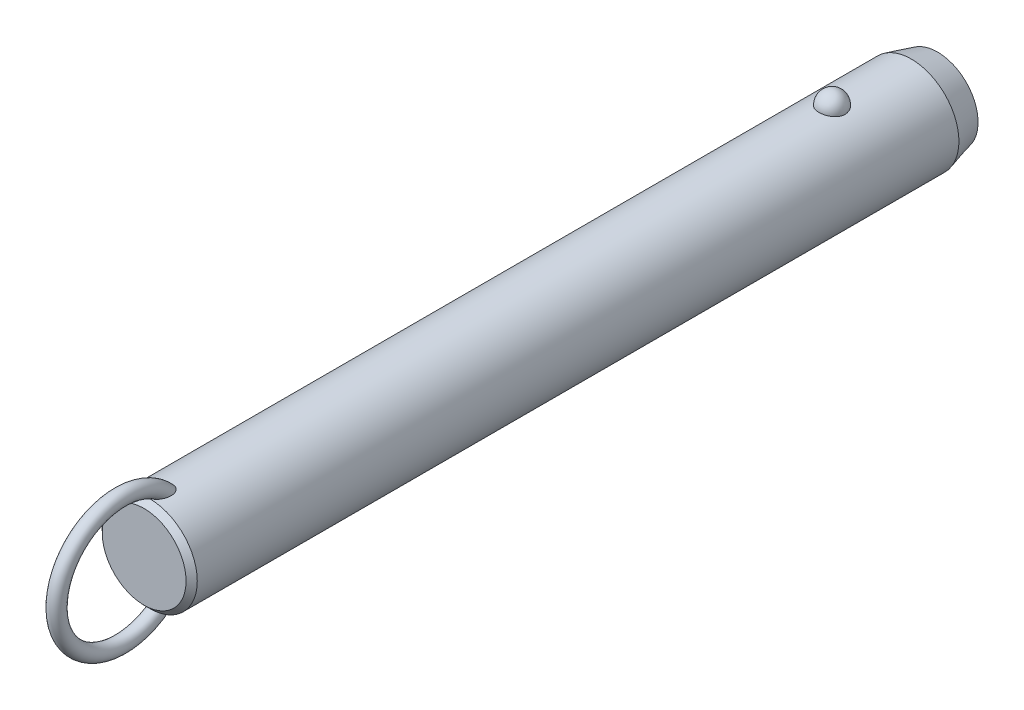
ISO-10303-21;
HEADER;
FILE_DESCRIPTION(('STEP AP214'),'2;1');
FILE_NAME('part.step','',(''),(''),'','','');
FILE_SCHEMA(('AUTOMOTIVE_DESIGN { 1 0 10303 214 1 1 1 1 }'));
ENDSEC;
DATA;
#1=APPLICATION_CONTEXT('core data for automotive mechanical design processes');
#2=APPLICATION_PROTOCOL_DEFINITION('international standard','automotive_design',2000,#1);
#3=PRODUCT_CONTEXT('',#1,'mechanical');
#4=PRODUCT('Part','Part','',(#3));
#5=PRODUCT_RELATED_PRODUCT_CATEGORY('part','',(#4));
#6=PRODUCT_DEFINITION_FORMATION('','',#4);
#7=PRODUCT_DEFINITION_CONTEXT('part definition',#1,'design');
#8=PRODUCT_DEFINITION('design','',#6,#7);
#9=PRODUCT_DEFINITION_SHAPE('','',#8);
#10=(LENGTH_UNIT() NAMED_UNIT(*) SI_UNIT(.MILLI.,.METRE.));
#11=(NAMED_UNIT(*) PLANE_ANGLE_UNIT() SI_UNIT($,.RADIAN.));
#12=(NAMED_UNIT(*) SI_UNIT($,.STERADIAN.) SOLID_ANGLE_UNIT());
#13=UNCERTAINTY_MEASURE_WITH_UNIT(LENGTH_MEASURE(1.E-05),#10,'distance_accuracy_value','');
#14=(GEOMETRIC_REPRESENTATION_CONTEXT(3) GLOBAL_UNCERTAINTY_ASSIGNED_CONTEXT((#13)) GLOBAL_UNIT_ASSIGNED_CONTEXT((#10,
#11,#12)) REPRESENTATION_CONTEXT('',''));
#15=CARTESIAN_POINT('',(0.,0.,0.));
#16=DIRECTION('',(0.,0.,1.));
#17=DIRECTION('',(1.,0.,0.));
#18=AXIS2_PLACEMENT_3D('',#15,#16,#17);
#19=CARTESIAN_POINT('',(0.,0.,167.6));
#20=DIRECTION('',(0.,0.,-1.));
#21=DIRECTION('',(-1.,0.,0.));
#22=AXIS2_PLACEMENT_3D('',#19,#20,#21);
#23=CYLINDRICAL_SURFACE('',#22,12.7);
#24=CARTESIAN_POINT('',(3.46661256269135,12.2177165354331,-3.5));
#25=CARTESIAN_POINT('',(3.4666090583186,12.2177194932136,-3.30432790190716));
#26=CARTESIAN_POINT('',(3.45063567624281,12.2222841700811,-3.10861112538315));
#27=CARTESIAN_POINT('',(3.38712451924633,12.2400345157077,-2.72271899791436));
#28=CARTESIAN_POINT('',(3.33957415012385,12.2532236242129,-2.53254588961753));
#29=CARTESIAN_POINT('',(3.2141234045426,12.286724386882,-2.16324948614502));
#30=CARTESIAN_POINT('',(3.13623639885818,12.3070329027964,-1.98412136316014));
#31=CARTESIAN_POINT('',(2.95205930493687,12.3525018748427,-1.64180592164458));
#32=CARTESIAN_POINT('',(2.84577003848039,12.3776621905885,-1.47861814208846));
#33=CARTESIAN_POINT('',(2.60688050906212,12.4301712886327,-1.17190583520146));
#34=CARTESIAN_POINT('',(2.47415697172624,12.4575299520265,-1.02847897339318));
#35=CARTESIAN_POINT('',(2.18615174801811,12.5112810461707,-0.766177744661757));
#36=CARTESIAN_POINT('',(2.03087002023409,12.5376734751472,-0.647303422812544));
#37=CARTESIAN_POINT('',(1.70237334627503,12.5864761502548,-0.437732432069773));
#38=CARTESIAN_POINT('',(1.52920948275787,12.6088972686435,-0.34695830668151));
#39=CARTESIAN_POINT('',(1.16944170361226,12.6473352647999,-0.195750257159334));
#40=CARTESIAN_POINT('',(0.982839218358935,12.663352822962,-0.135313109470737));
#41=CARTESIAN_POINT('',(0.604961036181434,12.6869706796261,-0.0473241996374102));
#42=CARTESIAN_POINT('',(0.413823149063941,12.6947125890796,-0.0192185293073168));
#43=CARTESIAN_POINT('',(0.0293827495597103,12.7014203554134,0.00517254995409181));
#44=CARTESIAN_POINT('',(-0.163919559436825,12.7003870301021,0.00146092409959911));
#45=CARTESIAN_POINT('',(-0.544374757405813,12.689735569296,-0.0373939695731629));
#46=CARTESIAN_POINT('',(-0.731575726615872,12.6802364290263,-0.0721015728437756));
#47=CARTESIAN_POINT('',(-1.09733277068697,12.6538333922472,-0.171364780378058));
#48=CARTESIAN_POINT('',(-1.27588869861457,12.6369293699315,-0.23592089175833));
#49=CARTESIAN_POINT('',(-1.6204698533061,12.5973946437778,-0.393548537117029));
#50=CARTESIAN_POINT('',(-1.78641865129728,12.5747321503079,-0.48677898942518));
#51=CARTESIAN_POINT('',(-2.10030671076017,12.5261316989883,-0.699110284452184));
#52=CARTESIAN_POINT('',(-2.24824419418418,12.5001934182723,-0.818213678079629));
#53=CARTESIAN_POINT('',(-2.52491489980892,12.4472906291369,-1.08157124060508));
#54=CARTESIAN_POINT('',(-2.65324222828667,12.4203160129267,-1.22624992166));
#55=CARTESIAN_POINT('',(-2.88410007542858,12.3687509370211,-1.53528325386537));
#56=CARTESIAN_POINT('',(-2.98662883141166,12.3441606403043,-1.69963924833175));
#57=CARTESIAN_POINT('',(-3.16432417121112,12.2998199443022,-2.04548497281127));
#58=CARTESIAN_POINT('',(-3.23917525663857,12.2801261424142,-2.22714424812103));
#59=CARTESIAN_POINT('',(-3.35800573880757,12.248167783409,-2.6009138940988));
#60=CARTESIAN_POINT('',(-3.4019860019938,12.2359030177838,-2.79302397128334));
#61=CARTESIAN_POINT('',(-3.45784812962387,12.2202347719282,-3.18140279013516));
#62=CARTESIAN_POINT('',(-3.46986123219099,12.2167950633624,-3.37765118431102));
#63=CARTESIAN_POINT('',(-3.46186273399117,12.2190638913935,-3.76943689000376));
#64=CARTESIAN_POINT('',(-3.44185196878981,12.2247721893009,-3.96497421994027));
#65=CARTESIAN_POINT('',(-3.37048652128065,12.2446381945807,-4.34881728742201));
#66=CARTESIAN_POINT('',(-3.31928253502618,12.2587552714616,-4.53715319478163));
#67=CARTESIAN_POINT('',(-3.18693461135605,12.2938237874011,-4.90231727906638));
#68=CARTESIAN_POINT('',(-3.1057895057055,12.3147754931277,-5.07914500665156));
#69=CARTESIAN_POINT('',(-2.91506431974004,12.3613125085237,-5.4173205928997));
#70=CARTESIAN_POINT('',(-2.80533587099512,12.3869217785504,-5.57858147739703));
#71=CARTESIAN_POINT('',(-2.560414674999,12.4398525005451,-5.88013283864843));
#72=CARTESIAN_POINT('',(-2.42522099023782,12.4671740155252,-6.02042254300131));
#73=CARTESIAN_POINT('',(-2.1323357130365,12.5205965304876,-6.27662798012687));
#74=CARTESIAN_POINT('',(-1.97456596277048,12.5466928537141,-6.39245542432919));
#75=CARTESIAN_POINT('',(-1.64115839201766,12.5946384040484,-6.59583547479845));
#76=CARTESIAN_POINT('',(-1.46552179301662,12.6164879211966,-6.68339001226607));
#77=CARTESIAN_POINT('',(-1.10356050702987,12.6532533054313,-6.82682153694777));
#78=CARTESIAN_POINT('',(-0.917391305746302,12.6682500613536,-6.88306988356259));
#79=CARTESIAN_POINT('',(-0.537836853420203,12.6900288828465,-6.96386887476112));
#80=CARTESIAN_POINT('',(-0.344452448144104,12.6968119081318,-6.9884232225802));
#81=CARTESIAN_POINT('',(0.0402577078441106,12.7013667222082,-7.00496469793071));
#82=CARTESIAN_POINT('',(0.231556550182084,12.6993008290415,-6.99753844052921));
#83=CARTESIAN_POINT('',(0.610105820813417,12.6867505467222,-6.95166366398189));
#84=CARTESIAN_POINT('',(0.797356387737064,12.6762664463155,-6.91321620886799));
#85=CARTESIAN_POINT('',(1.16186657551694,12.6480587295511,-6.80658431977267));
#86=CARTESIAN_POINT('',(1.33915951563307,12.6303611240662,-6.73850666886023));
#87=CARTESIAN_POINT('',(1.67968518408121,12.5896027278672,-6.57450875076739));
#88=CARTESIAN_POINT('',(1.84291705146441,12.5665416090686,-6.47858678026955));
#89=CARTESIAN_POINT('',(2.15340192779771,12.5171072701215,-6.25982455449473));
#90=CARTESIAN_POINT('',(2.30037831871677,12.4906895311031,-6.13660186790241));
#91=CARTESIAN_POINT('',(2.5717412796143,12.4376567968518,-5.86739587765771));
#92=CARTESIAN_POINT('',(2.69612388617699,12.4110417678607,-5.72140858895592));
#93=CARTESIAN_POINT('',(2.92107785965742,12.360051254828,-5.40794137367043));
#94=CARTESIAN_POINT('',(3.02121329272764,12.3357209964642,-5.24014110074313));
#95=CARTESIAN_POINT('',(3.19236291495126,12.2925446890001,-4.8896986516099));
#96=CARTESIAN_POINT('',(3.26338839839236,12.2736965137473,-4.70706226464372));
#97=CARTESIAN_POINT('',(3.36788038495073,12.245404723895,-4.35469510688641));
#98=CARTESIAN_POINT('',(3.40484026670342,12.2351018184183,-4.18605935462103));
#99=CARTESIAN_POINT('',(3.45420764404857,12.2212564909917,-3.84496058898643));
#100=CARTESIAN_POINT('',(3.46661565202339,12.2177139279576,-3.67249765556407));
#101=CARTESIAN_POINT('',(3.46661256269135,12.2177165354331,-3.5));
#102=B_SPLINE_CURVE_WITH_KNOTS('',3,(#24,#25,#26,#27,#28,#29,#30,#31,#32,#33,#34,#35,#36,#37,
#38,#39,#40,#41,#42,#43,#44,#45,#46,#47,#48,#49,#50,#51,#52,#53,#54,#55,#56,#57,#58,#59,#60,#61,
#62,#63,#64,#65,#66,#67,#68,#69,#70,#71,#72,#73,#74,#75,#76,#77,#78,#79,#80,#81,#82,#83,#84,#85,
#86,#87,#88,#89,#90,#91,#92,#93,#94,#95,#96,#97,#98,#99,#100,#101),.UNSPECIFIED.,.T.,.F.,(4,2,2,
2,2,2,2,2,2,2,2,2,2,2,2,2,2,2,2,2,2,2,2,2,2,2,2,2,2,2,2,2,2,2,2,2,2,2,4),(0.,0.586396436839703,
1.17302689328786,1.7593990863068,2.34575431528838,2.93491084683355,3.52406845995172,
4.1115873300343,4.69904375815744,5.2762784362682,5.85345931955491,6.42265312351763,
6.99185659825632,7.56427334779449,8.136746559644,8.71981013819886,9.3029135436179,
9.89247258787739,10.4820150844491,11.0691335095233,11.6562366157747,12.2405256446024,
12.8248374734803,13.412244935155,13.9996740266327,14.5891883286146,15.1786623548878,
15.7609861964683,16.3432419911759,16.914863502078,17.4864654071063,18.056024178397,
18.6256177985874,19.2037609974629,19.7820055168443,20.3699810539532,20.9577282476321,
21.4746855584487,21.9916320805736),.UNSPECIFIED.);
#103=CARTESIAN_POINT('',(3.46661256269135,12.2177165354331,-3.5));
#104=VERTEX_POINT('',#103);
#105=EDGE_CURVE('E41',#104,#104,#102,.T.);
#106=ORIENTED_EDGE('',*,*,#105,.T.);
#107=EDGE_LOOP('',(#106));
#108=FACE_BOUND('',#107,.T.);
#109=CARTESIAN_POINT('',(0.,0.,178.8));
#110=DIRECTION('',(0.,0.,1.));
#111=DIRECTION('',(1.,0.,0.));
#112=AXIS2_PLACEMENT_3D('',#109,#110,#111);
#113=CIRCLE('',#112,12.7);
#114=CARTESIAN_POINT('',(12.7,0.,178.8));
#115=VERTEX_POINT('',#114);
#116=EDGE_CURVE('E10',#115,#115,#113,.F.);
#117=ORIENTED_EDGE('',*,*,#116,.T.);
#118=EDGE_LOOP('',(#117));
#119=FACE_BOUND('',#118,.T.);
#120=CARTESIAN_POINT('',(-0.548122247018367,-12.6881662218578,172.543218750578));
#121=CARTESIAN_POINT('',(-0.648865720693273,-12.6838128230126,172.577926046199));
#122=CARTESIAN_POINT('',(-0.746398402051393,-12.6783867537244,172.622042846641));
#123=CARTESIAN_POINT('',(-0.932125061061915,-12.666091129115,172.726764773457));
#124=CARTESIAN_POINT('',(-1.02030388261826,-12.6592192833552,172.787396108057));
#125=CARTESIAN_POINT('',(-1.18487740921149,-12.6448747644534,172.921847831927));
#126=CARTESIAN_POINT('',(-1.26134296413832,-12.637406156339,172.995582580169));
#127=CARTESIAN_POINT('',(-1.40231200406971,-12.6225412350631,173.153604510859));
#128=CARTESIAN_POINT('',(-1.46681470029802,-12.6151449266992,173.23789238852));
#129=CARTESIAN_POINT('',(-1.60714786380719,-12.5981718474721,173.449657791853));
#130=CARTESIAN_POINT('',(-1.677251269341,-12.588900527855,173.580962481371));
#131=CARTESIAN_POINT('',(-1.79536591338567,-12.5725964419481,173.853247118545));
#132=CARTESIAN_POINT('',(-1.84333535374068,-12.5655679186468,173.994244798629));
#133=CARTESIAN_POINT('',(-1.93422576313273,-12.5519624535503,174.337645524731));
#134=CARTESIAN_POINT('',(-1.96788773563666,-12.5466298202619,174.542557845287));
#135=CARTESIAN_POINT('',(-1.99413993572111,-12.542463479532,174.851760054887));
#136=CARTESIAN_POINT('',(-1.99883864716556,-12.5417153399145,174.955298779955));
#137=CARTESIAN_POINT('',(-2.00078003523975,-12.5414074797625,175.16245124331));
#138=CARTESIAN_POINT('',(-1.99802449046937,-12.5418474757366,175.266064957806));
#139=CARTESIAN_POINT('',(-1.98336733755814,-12.5441750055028,175.510320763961));
#140=CARTESIAN_POINT('',(-1.96851430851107,-12.5465291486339,175.650780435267));
#141=CARTESIAN_POINT('',(-1.92707089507,-12.5529612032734,175.929960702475));
#142=CARTESIAN_POINT('',(-1.90047458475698,-12.5570399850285,176.068680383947));
#143=CARTESIAN_POINT('',(-1.8361912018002,-12.5666008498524,176.34341135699));
#144=CARTESIAN_POINT('',(-1.79850828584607,-12.57208240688,176.479423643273));
#145=CARTESIAN_POINT('',(-1.71223796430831,-12.5841228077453,176.747842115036));
#146=CARTESIAN_POINT('',(-1.66365679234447,-12.5906810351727,176.880250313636));
#147=CARTESIAN_POINT('',(-1.57804503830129,-12.6016176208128,177.08548877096));
#148=CARTESIAN_POINT('',(-1.54477252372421,-12.6057501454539,177.159914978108));
#149=CARTESIAN_POINT('',(-1.47424480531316,-12.6141930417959,177.306839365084));
#150=CARTESIAN_POINT('',(-1.43699041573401,-12.6185033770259,177.379337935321));
#151=CARTESIAN_POINT('',(-1.35825795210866,-12.6272207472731,177.521892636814));
#152=CARTESIAN_POINT('',(-1.31678520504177,-12.6316276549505,177.591951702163));
#153=CARTESIAN_POINT('',(-1.22917793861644,-12.6404532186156,177.729070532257));
#154=CARTESIAN_POINT('',(-1.18304514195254,-12.6448718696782,177.796131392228));
#155=CARTESIAN_POINT('',(-1.0724641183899,-12.6547893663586,177.943874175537));
#156=CARTESIAN_POINT('',(-1.00642239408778,-12.6602600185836,178.023384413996));
#157=CARTESIAN_POINT('',(-0.864441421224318,-12.6707460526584,178.173169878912));
#158=CARTESIAN_POINT('',(-0.788516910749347,-12.6757620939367,178.243458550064));
#159=CARTESIAN_POINT('',(-0.652215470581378,-12.6833591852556,178.348680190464));
#160=CARTESIAN_POINT('',(-0.594982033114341,-12.6861973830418,178.387624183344));
#161=CARTESIAN_POINT('',(-0.475269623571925,-12.6912445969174,178.456489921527));
#162=CARTESIAN_POINT('',(-0.412800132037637,-12.6934547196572,178.486427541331));
#163=CARTESIAN_POINT('',(-0.295749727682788,-12.6966636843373,178.529756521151));
#164=CARTESIAN_POINT('',(-0.24194995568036,-12.6978134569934,178.545218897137));
#165=CARTESIAN_POINT('',(-0.132508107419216,-12.6994261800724,178.566884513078));
#166=CARTESIAN_POINT('',(-0.0768679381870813,-12.6998898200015,178.573097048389));
#167=CARTESIAN_POINT('',(0.0347696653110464,-12.7000752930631,178.575583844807));
#168=CARTESIAN_POINT('',(0.0907676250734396,-12.6997954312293,178.571835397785));
#169=CARTESIAN_POINT('',(0.201283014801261,-12.6985255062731,178.554788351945));
#170=CARTESIAN_POINT('',(0.255799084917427,-12.6975348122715,178.541481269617));
#171=CARTESIAN_POINT('',(0.376042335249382,-12.6946091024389,178.50203792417));
#172=CARTESIAN_POINT('',(0.440950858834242,-12.6924943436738,178.473449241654));
#173=CARTESIAN_POINT('',(0.56535027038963,-12.6875639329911,178.406323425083));
#174=CARTESIAN_POINT('',(0.624828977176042,-12.6847467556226,178.36776463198));
#175=CARTESIAN_POINT('',(0.774116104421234,-12.6767252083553,178.256949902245));
#176=CARTESIAN_POINT('',(0.85944962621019,-12.6711344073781,178.178760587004));
#177=CARTESIAN_POINT('',(1.01789440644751,-12.6593922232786,178.010943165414));
#178=CARTESIAN_POINT('',(1.090969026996,-12.653239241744,177.921282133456));
#179=CARTESIAN_POINT('',(1.2226879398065,-12.6411674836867,177.740265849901));
#180=CARTESIAN_POINT('',(1.28193986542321,-12.6352572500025,177.649345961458));
#181=CARTESIAN_POINT('',(1.39259777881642,-12.623540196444,177.462792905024));
#182=CARTESIAN_POINT('',(1.44399707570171,-12.6177334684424,177.367155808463));
#183=CARTESIAN_POINT('',(1.53972870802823,-12.6064093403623,177.172273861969));
#184=CARTESIAN_POINT('',(1.58405262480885,-12.6008922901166,177.073024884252));
#185=CARTESIAN_POINT('',(1.6660070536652,-12.5903187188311,176.871772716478));
#186=CARTESIAN_POINT('',(1.70363651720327,-12.5852622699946,176.769769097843));
#187=CARTESIAN_POINT('',(1.77545379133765,-12.5753406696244,176.554358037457));
#188=CARTESIAN_POINT('',(1.80903453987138,-12.5705328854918,176.440745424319));
#189=CARTESIAN_POINT('',(1.8684416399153,-12.5618400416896,176.211457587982));
#190=CARTESIAN_POINT('',(1.89426665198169,-12.5579551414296,176.095782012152));
#191=CARTESIAN_POINT('',(1.93785464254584,-12.5513030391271,175.863007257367));
#192=CARTESIAN_POINT('',(1.95562640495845,-12.5485346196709,175.745909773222));
#193=CARTESIAN_POINT('',(1.98264463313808,-12.5442934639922,175.510747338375));
#194=CARTESIAN_POINT('',(1.99189298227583,-12.5428204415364,175.39268260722));
#195=CARTESIAN_POINT('',(2.00416068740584,-12.540871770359,175.080622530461));
#196=CARTESIAN_POINT('',(1.99944433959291,-12.541631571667,174.886229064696));
#197=CARTESIAN_POINT('',(1.96113755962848,-12.5476846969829,174.500309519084));
#198=CARTESIAN_POINT('',(1.92758341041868,-12.5529723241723,174.308780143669));
#199=CARTESIAN_POINT('',(1.83934342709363,-12.5661532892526,173.982272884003));
#200=CARTESIAN_POINT('',(1.79215440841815,-12.5730485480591,173.84524997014));
#201=CARTESIAN_POINT('',(1.67676242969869,-12.588958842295,173.580445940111));
#202=CARTESIAN_POINT('',(1.60859050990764,-12.5979707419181,173.452651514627));
#203=CARTESIAN_POINT('',(1.46583832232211,-12.6152829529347,173.235800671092));
#204=CARTESIAN_POINT('',(1.39525727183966,-12.6233659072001,173.14410500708));
#205=CARTESIAN_POINT('',(1.23992594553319,-12.6395676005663,172.973485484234));
#206=CARTESIAN_POINT('',(1.15517932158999,-12.6476863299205,172.894558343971));
#207=CARTESIAN_POINT('',(0.971995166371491,-12.6630846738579,172.752643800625));
#208=CARTESIAN_POINT('',(0.873456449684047,-12.6703572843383,172.689784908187));
#209=CARTESIAN_POINT('',(0.66584770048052,-12.6829569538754,172.584487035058));
#210=CARTESIAN_POINT('',(0.556784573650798,-12.688285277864,172.542034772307));
#211=CARTESIAN_POINT('',(0.347338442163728,-12.6956226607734,172.484443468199));
#212=CARTESIAN_POINT('',(0.247759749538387,-12.6979816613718,172.466399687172));
#213=CARTESIAN_POINT('',(0.0470218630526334,-12.7003077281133,172.448600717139));
#214=CARTESIAN_POINT('',(-0.0541350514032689,-12.7002779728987,172.448821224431));
#215=CARTESIAN_POINT('',(-0.221414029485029,-12.6982482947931,172.464363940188));
#216=CARTESIAN_POINT('',(-0.288055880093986,-12.6969033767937,172.474666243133));
#217=CARTESIAN_POINT('',(-0.419599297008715,-12.6932369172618,172.50313489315));
#218=CARTESIAN_POINT('',(-0.484501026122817,-12.6909154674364,172.521300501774));
#219=CARTESIAN_POINT('',(-0.548122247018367,-12.6881662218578,172.543218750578));
#220=B_SPLINE_CURVE_WITH_KNOTS('',3,(#120,#121,#122,#123,#124,#125,#126,#127,#128,#129,#130,
#131,#132,#133,#134,#135,#136,#137,#138,#139,#140,#141,#142,#143,#144,#145,#146,#147,#148,#149,
#150,#151,#152,#153,#154,#155,#156,#157,#158,#159,#160,#161,#162,#163,#164,#165,#166,#167,#168,
#169,#170,#171,#172,#173,#174,#175,#176,#177,#178,#179,#180,#181,#182,#183,#184,#185,#186,#187,
#188,#189,#190,#191,#192,#193,#194,#195,#196,#197,#198,#199,#200,#201,#202,#203,#204,#205,#206,
#207,#208,#209,#210,#211,#212,#213,#214,#215,#216,#217,#218,#219),.UNSPECIFIED.,.T.,.F.,(4,2,2,
2,2,2,2,2,2,2,2,2,2,2,2,2,2,2,2,2,2,2,2,2,2,2,2,2,2,2,2,2,2,2,2,2,2,2,2,2,2,2,2,2,2,2,2,2,2,4),
(0.,0.319642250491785,0.639794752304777,0.957927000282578,1.27608021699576,1.72100165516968,
2.16675988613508,2.78630021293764,3.09705782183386,3.4077412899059,3.83096358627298,
4.25439969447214,4.6776772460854,5.10071330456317,5.3455029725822,5.59024267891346,
5.83467707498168,6.07902143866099,6.38891080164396,6.69834321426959,6.90560910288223,
7.1125074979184,7.27977315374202,7.44687060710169,7.61434932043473,7.78197685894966,
7.9936554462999,8.20579780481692,8.55147335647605,8.89816429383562,9.22375138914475,
9.54961437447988,9.87586224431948,10.2021611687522,10.5575872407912,10.913074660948,
11.2681734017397,11.6231936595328,12.2046601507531,12.7853961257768,13.2191642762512,
13.6522938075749,13.9989174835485,14.3454519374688,14.694676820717,15.0436740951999,
15.3457513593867,15.647426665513,15.8493051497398,16.0511646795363),.UNSPECIFIED.);
#221=CARTESIAN_POINT('',(-0.548122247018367,-12.6881662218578,172.543218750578));
#222=VERTEX_POINT('',#221);
#223=EDGE_CURVE('E60',#222,#222,#220,.T.);
#224=ORIENTED_EDGE('',*,*,#223,.T.);
#225=EDGE_LOOP('',(#224));
#226=FACE_BOUND('',#225,.T.);
#227=CARTESIAN_POINT('',(-0.548122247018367,12.6881662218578,172.543218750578));
#228=CARTESIAN_POINT('',(-0.459436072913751,12.6919968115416,172.512673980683));
#229=CARTESIAN_POINT('',(-0.368189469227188,12.6949996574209,172.489391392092));
#230=CARTESIAN_POINT('',(-0.183024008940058,12.6990186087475,172.458406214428));
#231=CARTESIAN_POINT('',(-0.0891049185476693,12.7000345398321,172.450704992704));
#232=CARTESIAN_POINT('',(0.0987147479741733,12.6999636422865,172.451245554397));
#233=CARTESIAN_POINT('',(0.192615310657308,12.6988761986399,172.459492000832));
#234=CARTESIAN_POINT('',(0.377658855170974,12.6947211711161,172.491551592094));
#235=CARTESIAN_POINT('',(0.468801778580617,12.6916535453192,172.515365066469));
#236=CARTESIAN_POINT('',(0.645809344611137,12.6838788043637,172.57745651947));
#237=CARTESIAN_POINT('',(0.731679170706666,12.6791733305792,172.615720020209));
#238=CARTESIAN_POINT('',(0.896315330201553,12.6686004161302,172.705120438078));
#239=CARTESIAN_POINT('',(0.975080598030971,12.6627328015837,172.756259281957));
#240=CARTESIAN_POINT('',(1.12963655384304,12.6499161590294,172.87367820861));
#241=CARTESIAN_POINT('',(1.20478673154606,12.6429194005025,172.940792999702));
#242=CARTESIAN_POINT('',(1.34448241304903,12.6288282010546,173.08522507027));
#243=CARTESIAN_POINT('',(1.40902173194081,12.621733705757,173.162548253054));
#244=CARTESIAN_POINT('',(1.55208211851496,12.6050877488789,173.359247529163));
#245=CARTESIAN_POINT('',(1.62510490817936,12.5957546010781,173.482654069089));
#246=CARTESIAN_POINT('',(1.75019044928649,12.5789823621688,173.739769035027));
#247=CARTESIAN_POINT('',(1.8022137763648,12.5715468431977,173.873496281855));
#248=CARTESIAN_POINT('',(1.90309965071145,12.5567434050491,174.198351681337));
#249=CARTESIAN_POINT('',(1.94342317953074,12.5504515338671,174.392161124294));
#250=CARTESIAN_POINT('',(1.99332997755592,12.5426147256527,174.78378810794));
#251=CARTESIAN_POINT('',(2.00285305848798,12.5410790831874,174.981612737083));
#252=CARTESIAN_POINT('',(1.99678999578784,12.5420407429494,175.316642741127));
#253=CARTESIAN_POINT('',(1.98794117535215,12.5434564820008,175.454042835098));
#254=CARTESIAN_POINT('',(1.95865119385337,12.5480641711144,175.727639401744));
#255=CARTESIAN_POINT('',(1.93820436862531,12.5512569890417,175.863835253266));
#256=CARTESIAN_POINT('',(1.88647896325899,12.5591352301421,176.134249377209));
#257=CARTESIAN_POINT('',(1.85518800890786,12.5638223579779,176.268465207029));
#258=CARTESIAN_POINT('',(1.78217886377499,12.5743868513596,176.533936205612));
#259=CARTESIAN_POINT('',(1.74046509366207,12.5802637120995,176.665192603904));
#260=CARTESIAN_POINT('',(1.66024095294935,12.5910571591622,176.886085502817));
#261=CARTESIAN_POINT('',(1.62434772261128,12.5957535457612,176.976690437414));
#262=CARTESIAN_POINT('',(1.54709009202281,12.6054762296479,177.155512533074));
#263=CARTESIAN_POINT('',(1.50572681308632,12.6105024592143,177.243730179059));
#264=CARTESIAN_POINT('',(1.41728020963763,12.620748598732,177.416932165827));
#265=CARTESIAN_POINT('',(1.37021377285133,12.625967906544,177.501925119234));
#266=CARTESIAN_POINT('',(1.26969620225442,12.6364721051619,177.668007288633));
#267=CARTESIAN_POINT('',(1.21624929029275,12.6417569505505,177.749099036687));
#268=CARTESIAN_POINT('',(1.10304413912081,12.6521331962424,177.904702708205));
#269=CARTESIAN_POINT('',(1.04340936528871,12.657226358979,177.979303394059));
#270=CARTESIAN_POINT('',(0.915919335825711,12.667090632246,178.121324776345));
#271=CARTESIAN_POINT('',(0.848064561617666,12.6718617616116,178.18874589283));
#272=CARTESIAN_POINT('',(0.717035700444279,12.67987711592,178.300624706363));
#273=CARTESIAN_POINT('',(0.655526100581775,12.6832377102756,178.346997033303));
#274=CARTESIAN_POINT('',(0.525985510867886,12.6892676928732,178.429619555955));
#275=CARTESIAN_POINT('',(0.457969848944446,12.6919386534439,178.465892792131));
#276=CARTESIAN_POINT('',(0.334859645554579,12.695691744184,178.516657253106));
#277=CARTESIAN_POINT('',(0.281116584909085,12.6970073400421,178.534373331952));
#278=CARTESIAN_POINT('',(0.171425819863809,12.6989609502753,178.560642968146));
#279=CARTESIAN_POINT('',(0.115480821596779,12.699599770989,178.569207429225));
#280=CARTESIAN_POINT('',(0.00272618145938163,12.7001251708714,178.576253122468));
#281=CARTESIAN_POINT('',(-0.0540859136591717,12.7000089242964,178.574696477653));
#282=CARTESIAN_POINT('',(-0.166544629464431,12.6990328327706,178.561600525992));
#283=CARTESIAN_POINT('',(-0.222190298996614,12.6981724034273,178.550053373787));
#284=CARTESIAN_POINT('',(-0.342018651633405,12.695562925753,178.514912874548));
#285=CARTESIAN_POINT('',(-0.405606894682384,12.6936676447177,178.48933225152));
#286=CARTESIAN_POINT('',(-0.527815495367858,12.6891754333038,178.428311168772));
#287=CARTESIAN_POINT('',(-0.586425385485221,12.6865770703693,178.392850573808));
#288=CARTESIAN_POINT('',(-0.73184269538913,12.6792129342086,178.291496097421));
#289=CARTESIAN_POINT('',(-0.81470941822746,12.6740767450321,178.2200395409));
#290=CARTESIAN_POINT('',(-0.969101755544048,12.6632083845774,178.06589007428));
#291=CARTESIAN_POINT('',(-1.0405956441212,12.6574746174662,177.983166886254));
#292=CARTESIAN_POINT('',(-1.16981116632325,12.6461638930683,177.815809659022));
#293=CARTESIAN_POINT('',(-1.22811369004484,12.6405994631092,177.731616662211));
#294=CARTESIAN_POINT('',(-1.33743405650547,12.6295007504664,177.558579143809));
#295=CARTESIAN_POINT('',(-1.38844577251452,12.6239664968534,177.469730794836));
#296=CARTESIAN_POINT('',(-1.48400702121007,12.6130898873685,177.288389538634));
#297=CARTESIAN_POINT('',(-1.52854232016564,12.6077479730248,177.195889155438));
#298=CARTESIAN_POINT('',(-1.61150113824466,12.5974127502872,177.008160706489));
#299=CARTESIAN_POINT('',(-1.64992317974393,12.5924195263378,176.912931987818));
#300=CARTESIAN_POINT('',(-1.73468589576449,12.581070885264,176.68289362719));
#301=CARTESIAN_POINT('',(-1.77831261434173,12.5749388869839,176.547066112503));
#302=CARTESIAN_POINT('',(-1.85439734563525,12.5639437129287,176.272212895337));
#303=CARTESIAN_POINT('',(-1.88684994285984,12.5590811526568,176.133185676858));
#304=CARTESIAN_POINT('',(-1.94008483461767,12.550968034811,175.85309235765));
#305=CARTESIAN_POINT('',(-1.96088706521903,12.5477147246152,175.712030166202));
#306=CARTESIAN_POINT('',(-1.99000539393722,12.5431291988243,175.428668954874));
#307=CARTESIAN_POINT('',(-1.99832911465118,12.5417958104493,175.286370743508));
#308=CARTESIAN_POINT('',(-2.00166624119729,12.5412674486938,174.957627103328));
#309=CARTESIAN_POINT('',(-1.99178843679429,12.5428579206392,174.771088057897));
#310=CARTESIAN_POINT('',(-1.94455183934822,12.5502731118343,174.40162404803));
#311=CARTESIAN_POINT('',(-1.90724032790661,12.5560905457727,174.218693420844));
#312=CARTESIAN_POINT('',(-1.81330718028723,12.5699462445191,173.904848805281));
#313=CARTESIAN_POINT('',(-1.76338820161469,12.5771273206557,173.771910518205));
#314=CARTESIAN_POINT('',(-1.64305018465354,12.593414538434,173.515681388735));
#315=CARTESIAN_POINT('',(-1.57265346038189,12.6025185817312,173.392380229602));
#316=CARTESIAN_POINT('',(-1.42634956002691,12.6198178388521,173.183564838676));
#317=CARTESIAN_POINT('',(-1.35423772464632,12.6278405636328,173.095384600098));
#318=CARTESIAN_POINT('',(-1.19645664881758,12.6437632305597,172.932107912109));
#319=CARTESIAN_POINT('',(-1.11080536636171,12.6516633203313,172.856994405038));
#320=CARTESIAN_POINT('',(-0.947219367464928,12.6648319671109,172.737811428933));
#321=CARTESIAN_POINT('',(-0.871624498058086,12.670300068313,172.690541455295));
#322=CARTESIAN_POINT('',(-0.714161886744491,12.6801492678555,172.6077413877));
#323=CARTESIAN_POINT('',(-0.632295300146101,12.684530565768,172.57220913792));
#324=CARTESIAN_POINT('',(-0.548122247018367,12.6881662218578,172.543218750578));
#325=B_SPLINE_CURVE_WITH_KNOTS('',3,(#227,#228,#229,#230,#231,#232,#233,#234,#235,#236,#237,
#238,#239,#240,#241,#242,#243,#244,#245,#246,#247,#248,#249,#250,#251,#252,#253,#254,#255,#256,
#257,#258,#259,#260,#261,#262,#263,#264,#265,#266,#267,#268,#269,#270,#271,#272,#273,#274,#275,
#276,#277,#278,#279,#280,#281,#282,#283,#284,#285,#286,#287,#288,#289,#290,#291,#292,#293,#294,
#295,#296,#297,#298,#299,#300,#301,#302,#303,#304,#305,#306,#307,#308,#309,#310,#311,#312,#313,
#314,#315,#316,#317,#318,#319,#320,#321,#322,#323,#324),.UNSPECIFIED.,.T.,.F.,(4,2,2,2,2,2,2,2,
2,2,2,2,2,2,2,2,2,2,2,2,2,2,2,2,2,2,2,2,2,2,2,2,2,2,2,2,2,2,2,2,2,2,2,2,2,2,2,2,4),(0.,
0.281328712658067,0.562682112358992,0.844117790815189,1.12555942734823,1.40671982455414,
1.68792232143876,1.98972294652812,2.29169886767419,2.72039860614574,3.14989948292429,
3.74084916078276,4.33295293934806,4.74554109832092,5.15833092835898,5.57159335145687,
5.98468079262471,6.27722775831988,6.56971484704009,6.86135609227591,7.15280542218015,
7.43927407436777,7.72572595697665,7.95635862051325,8.18646071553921,8.35559393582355,
8.52452541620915,8.69408946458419,8.86378678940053,9.06834348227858,9.27332014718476,
9.60010414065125,9.92778432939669,10.2350252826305,10.5425229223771,10.8506864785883,
11.15892440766,11.5867893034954,12.0148612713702,12.4421984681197,12.8692745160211,
13.4279365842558,13.9856380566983,14.4107062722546,14.835313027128,15.1765567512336,
15.517351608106,15.7844129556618,16.051425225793),.UNSPECIFIED.);
#326=CARTESIAN_POINT('',(-0.548122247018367,12.6881662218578,172.543218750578));
#327=VERTEX_POINT('',#326);
#328=EDGE_CURVE('E68',#327,#327,#325,.T.);
#329=ORIENTED_EDGE('',*,*,#328,.T.);
#330=EDGE_LOOP('',(#329));
#331=FACE_BOUND('',#330,.T.);
#332=CARTESIAN_POINT('',(0.,0.,-24.6999999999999));
#333=DIRECTION('',(0.,0.,-1.));
#334=DIRECTION('',(-1.,0.,0.));
#335=AXIS2_PLACEMENT_3D('',#332,#333,#334);
#336=CIRCLE('',#335,12.7);
#337=CARTESIAN_POINT('',(-12.7,0.,-24.6999999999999));
#338=VERTEX_POINT('',#337);
#339=EDGE_CURVE('E57',#338,#338,#336,.F.);
#340=ORIENTED_EDGE('',*,*,#339,.T.);
#341=EDGE_LOOP('',(#340));
#342=FACE_BOUND('',#341,.T.);
#343=ADVANCED_FACE('F37',(#108,#119,#226,#331,#342),#23,.T.);
#344=CARTESIAN_POINT('',(0.,0.,-31.7));
#345=DIRECTION('',(0.,0.,-1.));
#346=DIRECTION('',(-1.,0.,0.));
#347=AXIS2_PLACEMENT_3D('',#344,#345,#346);
#348=PLANE('',#347);
#349=CARTESIAN_POINT('',(0.,0.,-31.7));
#350=DIRECTION('',(0.,0.,-1.));
#351=DIRECTION('',(-1.,0.,0.));
#352=AXIS2_PLACEMENT_3D('',#349,#350,#351);
#353=CIRCLE('',#352,10.8243556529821);
#354=CARTESIAN_POINT('',(-10.8243556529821,0.,-31.7));
#355=VERTEX_POINT('',#354);
#356=EDGE_CURVE('E67',#355,#355,#353,.T.);
#357=ORIENTED_EDGE('',*,*,#356,.T.);
#358=EDGE_LOOP('',(#357));
#359=FACE_BOUND('',#358,.T.);
#360=ADVANCED_FACE('F86',(#359),#348,.T.);
#361=CARTESIAN_POINT('',(0.,0.,-31.7));
#362=DIRECTION('',(0.,0.,1.));
#363=DIRECTION('',(1.,0.,0.));
#364=AXIS2_PLACEMENT_3D('',#361,#362,#363);
#365=CONICAL_SURFACE('',#364,10.8243556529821,0.261799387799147);
#366=ORIENTED_EDGE('',*,*,#339,.F.);
#367=EDGE_LOOP('',(#366));
#368=FACE_BOUND('',#367,.T.);
#369=ORIENTED_EDGE('',*,*,#356,.F.);
#370=EDGE_LOOP('',(#369));
#371=FACE_BOUND('',#370,.T.);
#372=ADVANCED_FACE('F84',(#368,#371),#365,.T.);
#373=CARTESIAN_POINT('',(0.,0.,180.3));
#374=DIRECTION('',(0.,0.,1.));
#375=DIRECTION('',(1.,0.,0.));
#376=AXIS2_PLACEMENT_3D('',#373,#374,#375);
#377=PLANE('',#376);
#378=CARTESIAN_POINT('',(0.,0.,180.3));
#379=DIRECTION('',(0.,0.,1.));
#380=DIRECTION('',(1.,0.,0.));
#381=AXIS2_PLACEMENT_3D('',#378,#379,#380);
#382=CIRCLE('',#381,11.2);
#383=CARTESIAN_POINT('',(11.2,0.,180.3));
#384=VERTEX_POINT('',#383);
#385=EDGE_CURVE('E50',#384,#384,#382,.T.);
#386=ORIENTED_EDGE('',*,*,#385,.T.);
#387=EDGE_LOOP('',(#386));
#388=FACE_BOUND('',#387,.T.);
#389=ADVANCED_FACE('F78',(#388),#377,.T.);
#390=CARTESIAN_POINT('',(0.,0.,186.65));
#391=DIRECTION('',(1.,0.,0.));
#392=DIRECTION('',(0.,0.,-1.));
#393=AXIS2_PLACEMENT_3D('',#390,#391,#392);
#394=TOROIDAL_SURFACE('',#393,17.05,2.);
#395=ORIENTED_EDGE('',*,*,#328,.F.);
#396=EDGE_LOOP('',(#395));
#397=FACE_BOUND('',#396,.T.);
#398=ORIENTED_EDGE('',*,*,#223,.F.);
#399=EDGE_LOOP('',(#398));
#400=FACE_BOUND('',#399,.T.);
#401=ADVANCED_FACE('F74',(#397,#400),#394,.T.);
#402=CARTESIAN_POINT('',(0.,0.,180.3));
#403=DIRECTION('',(0.,0.,-1.));
#404=DIRECTION('',(-1.,0.,0.));
#405=AXIS2_PLACEMENT_3D('',#402,#403,#404);
#406=CONICAL_SURFACE('',#405,11.2,0.785398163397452);
#407=ORIENTED_EDGE('',*,*,#116,.F.);
#408=EDGE_LOOP('',(#407));
#409=FACE_BOUND('',#408,.T.);
#410=ORIENTED_EDGE('',*,*,#385,.F.);
#411=EDGE_LOOP('',(#410));
#412=FACE_BOUND('',#411,.T.);
#413=ADVANCED_FACE('F39',(#409,#412),#406,.T.);
#414=CARTESIAN_POINT('',(0.,12.7,-3.5));
#415=DIRECTION('',(0.,1.,0.));
#416=DIRECTION('',(0.,0.,1.));
#417=AXIS2_PLACEMENT_3D('',#414,#415,#416);
#418=SPHERICAL_SURFACE('',#417,3.5);
#419=ORIENTED_EDGE('',*,*,#105,.F.);
#420=EDGE_LOOP('',(#419));
#421=FACE_BOUND('',#420,.T.);
#422=ADVANCED_FACE('F80',(#421),#418,.T.);
#423=CLOSED_SHELL('',(#343,#360,#372,#389,#401,#413,#422));
#424=MANIFOLD_SOLID_BREP('B2',#423);
#425=ADVANCED_BREP_SHAPE_REPRESENTATION('',(#18,#424),#14);
#426=SHAPE_DEFINITION_REPRESENTATION(#9,#425);
ENDSEC;
END-ISO-10303-21;
